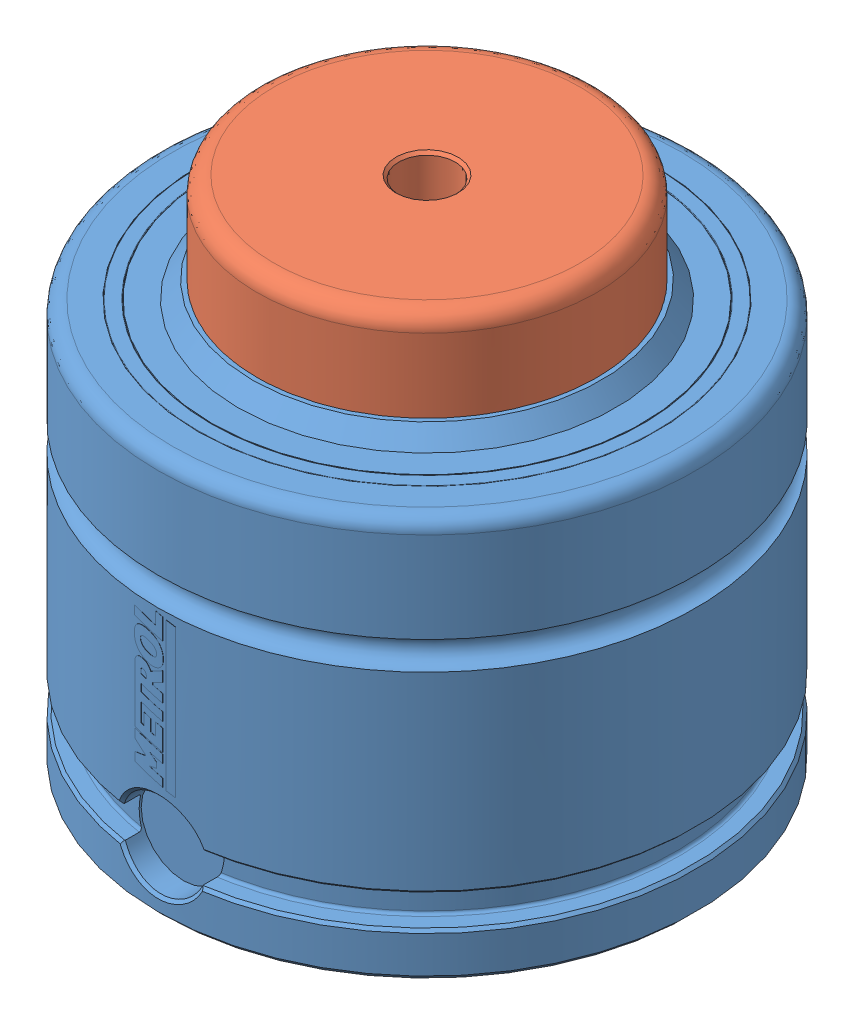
SolidWorks assembly EX4200-016.SLDASM, configuration Default (file format 7000). Lengths in mm.
Overall size (100.66 90 100.66).
2 component instances, 2 part files, 5 mates.
Components (placement in the parent):
- EX4200 Body-1: EX4200 Body.SLDPRT [EX-4200-016] x (0 0 1) z (0 -1 0) size (95.1 95 74)
- EX4200 Piston-1: EX4200 Piston.SLDPRT [EX-4200-016] at (0 56 0) x (0.306358 0 -0.951917) z (0 -1 0) size (80 80 34)
Mates (geometry in assembly coordinates):
- Concentric1: concentric aligned: cylinder of EX4200 Body-1 through (0 0 0) axis (0 -1 0) radius 30; cylinder of EX4200 Piston-1 through (0 56 0) axis (0 -1 0) radius 30
- LimitDistance1: limit distance anti-aligned: plane of EX4200 Piston-1 through (38.0767 61 12.2543) normal (0 1 0); plane of EX4200 Body-1 through (-30 61 0) normal (0 -1 0)
- Coincident1: coincident anti-aligned: plane of EX4200 Body-1 through (0 0 0) normal (0 -1 0); plane of assembly through (0 0 0) normal (0 1 0)
- Coincident2: coincident anti-aligned: plane of EX4200 Body-1; plane of assembly through (0 0 0) normal (1 0 0)
- Coincident6: coincident aligned: plane of EX4200 Body-1; plane of assembly through (0 0 0) normal (0 0 1)
